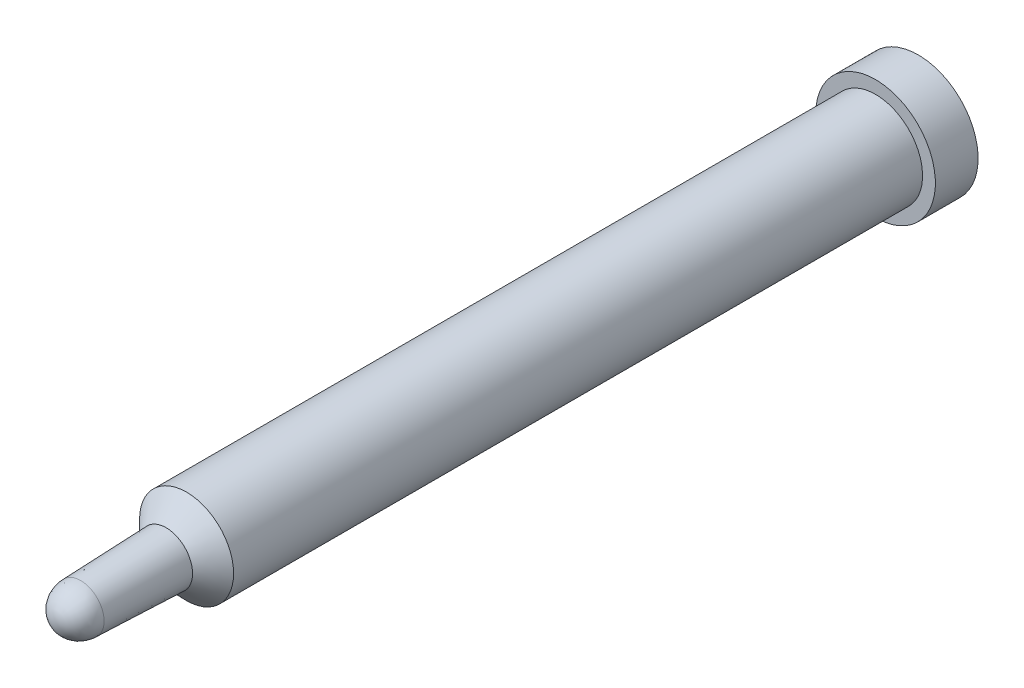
ISO-10303-21;
HEADER;
FILE_DESCRIPTION(('STEP AP214'),'2;1');
FILE_NAME('part.step','',(''),(''),'','','');
FILE_SCHEMA(('AUTOMOTIVE_DESIGN { 1 0 10303 214 1 1 1 1 }'));
ENDSEC;
DATA;
#1=APPLICATION_CONTEXT('core data for automotive mechanical design processes');
#2=APPLICATION_PROTOCOL_DEFINITION('international standard','automotive_design',2000,#1);
#3=PRODUCT_CONTEXT('',#1,'mechanical');
#4=PRODUCT('Part','Part','',(#3));
#5=PRODUCT_RELATED_PRODUCT_CATEGORY('part','',(#4));
#6=PRODUCT_DEFINITION_FORMATION('','',#4);
#7=PRODUCT_DEFINITION_CONTEXT('part definition',#1,'design');
#8=PRODUCT_DEFINITION('design','',#6,#7);
#9=PRODUCT_DEFINITION_SHAPE('','',#8);
#10=(LENGTH_UNIT() NAMED_UNIT(*) SI_UNIT(.MILLI.,.METRE.));
#11=(NAMED_UNIT(*) PLANE_ANGLE_UNIT() SI_UNIT($,.RADIAN.));
#12=(NAMED_UNIT(*) SI_UNIT($,.STERADIAN.) SOLID_ANGLE_UNIT());
#13=UNCERTAINTY_MEASURE_WITH_UNIT(LENGTH_MEASURE(1.E-05),#10,'distance_accuracy_value','');
#14=(GEOMETRIC_REPRESENTATION_CONTEXT(3) GLOBAL_UNCERTAINTY_ASSIGNED_CONTEXT((#13)) GLOBAL_UNIT_ASSIGNED_CONTEXT((#10,
#11,#12)) REPRESENTATION_CONTEXT('',''));
#15=CARTESIAN_POINT('',(0.,0.,0.));
#16=DIRECTION('',(0.,0.,1.));
#17=DIRECTION('',(1.,0.,0.));
#18=AXIS2_PLACEMENT_3D('',#15,#16,#17);
#19=CARTESIAN_POINT('',(0.,0.,88.));
#20=DIRECTION('',(0.,0.,-1.));
#21=DIRECTION('',(-1.,0.,0.));
#22=AXIS2_PLACEMENT_3D('',#19,#20,#21);
#23=CYLINDRICAL_SURFACE('',#22,5.5);
#24=CARTESIAN_POINT('',(0.,0.,85.6));
#25=DIRECTION('',(0.,0.,1.));
#26=DIRECTION('',(1.,0.,0.));
#27=AXIS2_PLACEMENT_3D('',#24,#25,#26);
#28=CIRCLE('',#27,5.5);
#29=CARTESIAN_POINT('',(5.5,0.,85.6));
#30=VERTEX_POINT('',#29);
#31=EDGE_CURVE('E38',#30,#30,#28,.F.);
#32=ORIENTED_EDGE('',*,*,#31,.T.);
#33=EDGE_LOOP('',(#32));
#34=FACE_BOUND('',#33,.T.);
#35=CARTESIAN_POINT('',(0.,0.,5.));
#36=DIRECTION('',(0.,0.,-1.));
#37=DIRECTION('',(-1.,0.,0.));
#38=AXIS2_PLACEMENT_3D('',#35,#36,#37);
#39=CIRCLE('',#38,5.5);
#40=CARTESIAN_POINT('',(-5.5,0.,5.));
#41=VERTEX_POINT('',#40);
#42=EDGE_CURVE('E11',#41,#41,#39,.T.);
#43=ORIENTED_EDGE('',*,*,#42,.F.);
#44=EDGE_LOOP('',(#43));
#45=FACE_BOUND('',#44,.T.);
#46=ADVANCED_FACE('F31',(#34,#45),#23,.T.);
#47=CARTESIAN_POINT('',(0.,0.,88.));
#48=DIRECTION('',(0.,0.,-1.));
#49=DIRECTION('',(-1.,0.,0.));
#50=AXIS2_PLACEMENT_3D('',#47,#48,#49);
#51=CONICAL_SURFACE('',#50,3.1,0.785398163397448);
#52=ORIENTED_EDGE('',*,*,#31,.F.);
#53=EDGE_LOOP('',(#52));
#54=FACE_BOUND('',#53,.T.);
#55=CARTESIAN_POINT('',(0.,0.,88.));
#56=DIRECTION('',(0.,0.,1.));
#57=DIRECTION('',(1.,0.,0.));
#58=AXIS2_PLACEMENT_3D('',#55,#56,#57);
#59=CIRCLE('',#58,3.1);
#60=CARTESIAN_POINT('',(3.1,0.,88.));
#61=VERTEX_POINT('',#60);
#62=EDGE_CURVE('E49',#61,#61,#59,.T.);
#63=ORIENTED_EDGE('',*,*,#62,.F.);
#64=EDGE_LOOP('',(#63));
#65=FACE_BOUND('',#64,.T.);
#66=ADVANCED_FACE('F79',(#54,#65),#51,.T.);
#67=CARTESIAN_POINT('',(0.,0.,88.));
#68=DIRECTION('',(0.,0.,-1.));
#69=DIRECTION('',(1.,0.,0.));
#70=AXIS2_PLACEMENT_3D('',#67,#68,#69);
#71=CONICAL_SURFACE('',#70,3.1,0.0349065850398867);
#72=CARTESIAN_POINT('',(0.,0.,98.));
#73=DIRECTION('',(0.,0.,1.));
#74=DIRECTION('',(1.,0.,0.));
#75=AXIS2_PLACEMENT_3D('',#72,#73,#74);
#76=CIRCLE('',#75,2.75079230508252);
#77=CARTESIAN_POINT('',(2.75079230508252,0.,98.));
#78=VERTEX_POINT('',#77);
#79=EDGE_CURVE('E47',#78,#78,#76,.T.);
#80=ORIENTED_EDGE('',*,*,#79,.F.);
#81=EDGE_LOOP('',(#80));
#82=FACE_BOUND('',#81,.T.);
#83=ORIENTED_EDGE('',*,*,#62,.T.);
#84=EDGE_LOOP('',(#83));
#85=FACE_BOUND('',#84,.T.);
#86=ADVANCED_FACE('F44',(#82,#85),#71,.T.);
#87=CARTESIAN_POINT('',(0.,0.,98.));
#88=DIRECTION('',(0.,1.,0.));
#89=DIRECTION('',(0.,0.,1.));
#90=AXIS2_PLACEMENT_3D('',#87,#88,#89);
#91=ELLIPSE('',#90,3.,2.75079230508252);
#92=TRIMMED_CURVE('',#91,(PARAMETER_VALUE(0.)),(PARAMETER_VALUE(3.14159265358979)),.T.,.PARAMETER.);
#93=CARTESIAN_POINT('',(0.,0.,95.));
#94=DIRECTION('',(0.,0.,1.));
#95=AXIS1_PLACEMENT('',#93,#94);
#96=SURFACE_OF_REVOLUTION('',#92,#95);
#97=CARTESIAN_POINT('',(0.,0.,101.));
#98=VERTEX_POINT('',#97);
#99=VERTEX_LOOP('',#98);
#100=FACE_BOUND('',#99,.T.);
#101=ORIENTED_EDGE('',*,*,#79,.T.);
#102=EDGE_LOOP('',(#101));
#103=FACE_BOUND('',#102,.T.);
#104=ADVANCED_FACE('F33',(#100,#103),#96,.F.);
#105=CARTESIAN_POINT('',(0.,0.,5.));
#106=DIRECTION('',(0.,0.,-1.));
#107=DIRECTION('',(-1.,0.,0.));
#108=AXIS2_PLACEMENT_3D('',#105,#106,#107);
#109=PLANE('',#108);
#110=CARTESIAN_POINT('',(0.,0.,5.));
#111=DIRECTION('',(0.,0.,-1.));
#112=DIRECTION('',(-1.,0.,0.));
#113=AXIS2_PLACEMENT_3D('',#110,#111,#112);
#114=CIRCLE('',#113,7.);
#115=CARTESIAN_POINT('',(-7.,0.,5.));
#116=VERTEX_POINT('',#115);
#117=EDGE_CURVE('E50',#116,#116,#114,.T.);
#118=ORIENTED_EDGE('',*,*,#117,.F.);
#119=EDGE_LOOP('',(#118));
#120=FACE_BOUND('',#119,.T.);
#121=ORIENTED_EDGE('',*,*,#42,.T.);
#122=EDGE_LOOP('',(#121));
#123=FACE_BOUND('',#122,.T.);
#124=ADVANCED_FACE('F43',(#120,#123),#109,.F.);
#125=CARTESIAN_POINT('',(0.,0.,5.));
#126=DIRECTION('',(0.,0.,-1.));
#127=DIRECTION('',(-1.,0.,0.));
#128=AXIS2_PLACEMENT_3D('',#125,#126,#127);
#129=CYLINDRICAL_SURFACE('',#128,7.);
#130=ORIENTED_EDGE('',*,*,#117,.T.);
#131=EDGE_LOOP('',(#130));
#132=FACE_BOUND('',#131,.T.);
#133=CARTESIAN_POINT('',(0.,0.,0.));
#134=DIRECTION('',(0.,0.,-1.));
#135=DIRECTION('',(-1.,0.,0.));
#136=AXIS2_PLACEMENT_3D('',#133,#134,#135);
#137=CIRCLE('',#136,7.);
#138=CARTESIAN_POINT('',(-7.,0.,0.));
#139=VERTEX_POINT('',#138);
#140=EDGE_CURVE('E55',#139,#139,#137,.T.);
#141=ORIENTED_EDGE('',*,*,#140,.F.);
#142=EDGE_LOOP('',(#141));
#143=FACE_BOUND('',#142,.T.);
#144=ADVANCED_FACE('F66',(#132,#143),#129,.T.);
#145=CARTESIAN_POINT('',(0.,0.,0.));
#146=DIRECTION('',(0.,0.,1.));
#147=DIRECTION('',(1.,0.,0.));
#148=AXIS2_PLACEMENT_3D('',#145,#146,#147);
#149=PLANE('',#148);
#150=ORIENTED_EDGE('',*,*,#140,.T.);
#151=EDGE_LOOP('',(#150));
#152=FACE_BOUND('',#151,.T.);
#153=ADVANCED_FACE('F64',(#152),#149,.F.);
#154=CLOSED_SHELL('',(#46,#66,#86,#104,#124,#144,#153));
#155=MANIFOLD_SOLID_BREP('B2',#154);
#156=ADVANCED_BREP_SHAPE_REPRESENTATION('',(#18,#155),#14);
#157=SHAPE_DEFINITION_REPRESENTATION(#9,#156);
ENDSEC;
END-ISO-10303-21;
